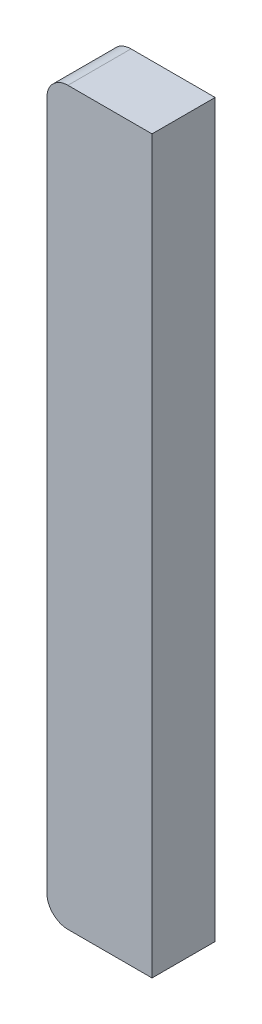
from build123d import *

# Parameters (mm, degrees)
BOSS_EXTRU_2_DEPTH = 3


with BuildPart() as part:
    # Esquisse1 → Boss.-Extru.2 (new body)
    with BuildSketch(Plane.XY):
        with BuildLine():
            Line((0, -7.909897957), (0, -42.665103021))
            Line((0, -42.665103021), (-4, -42.665103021))
            ThreePointArc((-4, -42.665103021), (-4.707106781, -42.372209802), (-5, -41.665103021))
            Line((-5, -41.665103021), (-5, -8.909897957))
            ThreePointArc((-5, -8.909897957), (-4.707106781, -8.202791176), (-4, -7.909897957))
            Line((-4, -7.909897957), (0, -7.909897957))
        make_face()
    extrude(amount=BOSS_EXTRU_2_DEPTH)


solid = part.part
